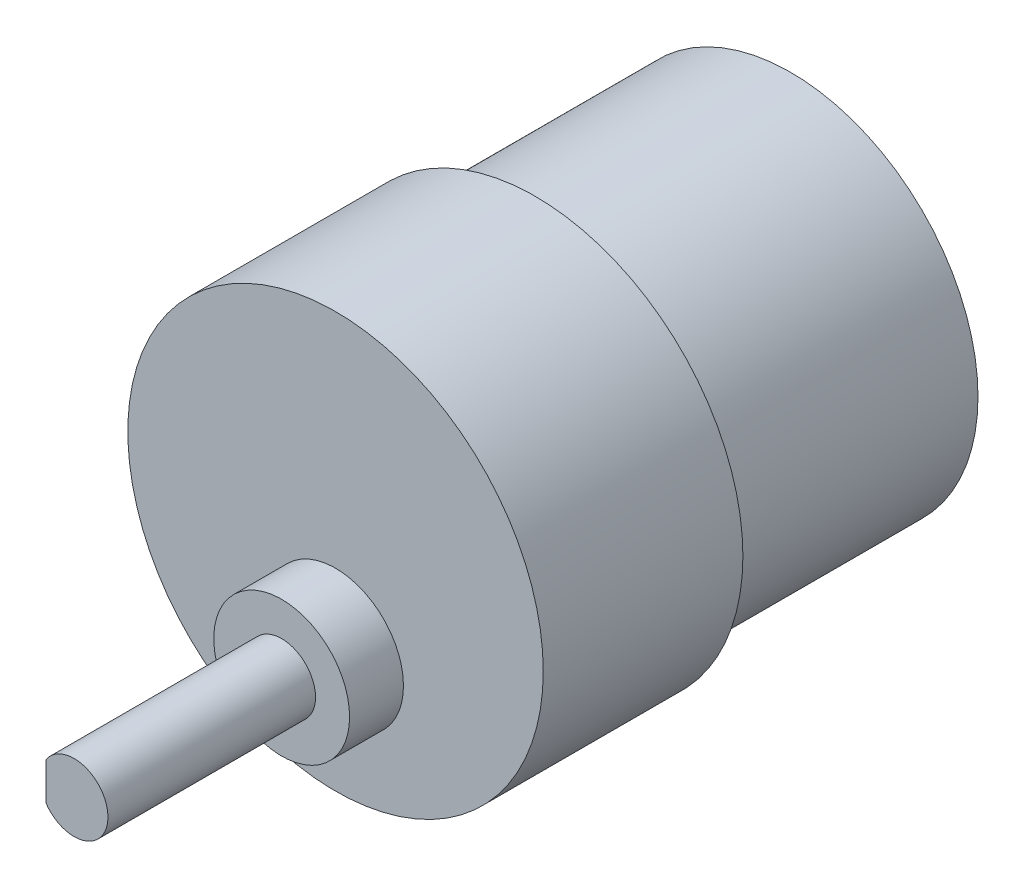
ISO-10303-21;
HEADER;
FILE_DESCRIPTION(('STEP AP214'),'2;1');
FILE_NAME('part.step','',(''),(''),'','','');
FILE_SCHEMA(('AUTOMOTIVE_DESIGN { 1 0 10303 214 1 1 1 1 }'));
ENDSEC;
DATA;
#1=APPLICATION_CONTEXT('core data for automotive mechanical design processes');
#2=APPLICATION_PROTOCOL_DEFINITION('international standard','automotive_design',2000,#1);
#3=PRODUCT_CONTEXT('',#1,'mechanical');
#4=PRODUCT('Part','Part','',(#3));
#5=PRODUCT_RELATED_PRODUCT_CATEGORY('part','',(#4));
#6=PRODUCT_DEFINITION_FORMATION('','',#4);
#7=PRODUCT_DEFINITION_CONTEXT('part definition',#1,'design');
#8=PRODUCT_DEFINITION('design','',#6,#7);
#9=PRODUCT_DEFINITION_SHAPE('','',#8);
#10=(LENGTH_UNIT() NAMED_UNIT(*) SI_UNIT(.MILLI.,.METRE.));
#11=(NAMED_UNIT(*) PLANE_ANGLE_UNIT() SI_UNIT($,.RADIAN.));
#12=(NAMED_UNIT(*) SI_UNIT($,.STERADIAN.) SOLID_ANGLE_UNIT());
#13=UNCERTAINTY_MEASURE_WITH_UNIT(LENGTH_MEASURE(1.E-05),#10,'distance_accuracy_value','');
#14=(GEOMETRIC_REPRESENTATION_CONTEXT(3) GLOBAL_UNCERTAINTY_ASSIGNED_CONTEXT((#13)) GLOBAL_UNIT_ASSIGNED_CONTEXT((#10,
#11,#12)) REPRESENTATION_CONTEXT('',''));
#15=CARTESIAN_POINT('',(0.,0.,0.));
#16=DIRECTION('',(0.,0.,1.));
#17=DIRECTION('',(1.,0.,0.));
#18=AXIS2_PLACEMENT_3D('',#15,#16,#17);
#19=CARTESIAN_POINT('',(0.,0.,22.5298));
#20=DIRECTION('',(0.,0.,-1.));
#21=DIRECTION('',(-1.,0.,0.));
#22=AXIS2_PLACEMENT_3D('',#19,#20,#21);
#23=CYLINDRICAL_SURFACE('',#22,16.51);
#24=CARTESIAN_POINT('',(0.,0.,22.5298));
#25=DIRECTION('',(0.,0.,1.));
#26=DIRECTION('',(1.,0.,0.));
#27=AXIS2_PLACEMENT_3D('',#24,#25,#26);
#28=CIRCLE('',#27,16.51);
#29=CARTESIAN_POINT('',(16.51,0.,22.5298));
#30=VERTEX_POINT('',#29);
#31=EDGE_CURVE('E40',#30,#30,#28,.T.);
#32=ORIENTED_EDGE('',*,*,#31,.F.);
#33=EDGE_LOOP('',(#32));
#34=FACE_BOUND('',#33,.T.);
#35=CARTESIAN_POINT('',(0.,0.,0.));
#36=DIRECTION('',(0.,0.,1.));
#37=DIRECTION('',(1.,0.,0.));
#38=AXIS2_PLACEMENT_3D('',#35,#36,#37);
#39=CIRCLE('',#38,16.51);
#40=CARTESIAN_POINT('',(16.51,0.,0.));
#41=VERTEX_POINT('',#40);
#42=EDGE_CURVE('E88',#41,#41,#39,.T.);
#43=ORIENTED_EDGE('',*,*,#42,.T.);
#44=EDGE_LOOP('',(#43));
#45=FACE_BOUND('',#44,.T.);
#46=ADVANCED_FACE('F33',(#34,#45),#23,.T.);
#47=CARTESIAN_POINT('',(0.,0.,0.));
#48=DIRECTION('',(0.,0.,1.));
#49=DIRECTION('',(1.,0.,0.));
#50=AXIS2_PLACEMENT_3D('',#47,#48,#49);
#51=PLANE('',#50);
#52=ORIENTED_EDGE('',*,*,#42,.F.);
#53=EDGE_LOOP('',(#52));
#54=FACE_BOUND('',#53,.T.);
#55=ADVANCED_FACE('F96',(#54),#51,.F.);
#56=CARTESIAN_POINT('',(0.,0.,40.132));
#57=DIRECTION('',(0.,0.,-1.));
#58=DIRECTION('',(-1.,0.,0.));
#59=AXIS2_PLACEMENT_3D('',#56,#57,#58);
#60=CYLINDRICAL_SURFACE('',#59,18.3134);
#61=CARTESIAN_POINT('',(0.,0.,40.132));
#62=DIRECTION('',(0.,0.,1.));
#63=DIRECTION('',(1.,0.,0.));
#64=AXIS2_PLACEMENT_3D('',#61,#62,#63);
#65=CIRCLE('',#64,18.3134);
#66=CARTESIAN_POINT('',(18.3134,0.,40.132));
#67=VERTEX_POINT('',#66);
#68=EDGE_CURVE('E85',#67,#67,#65,.T.);
#69=ORIENTED_EDGE('',*,*,#68,.F.);
#70=EDGE_LOOP('',(#69));
#71=FACE_BOUND('',#70,.T.);
#72=CARTESIAN_POINT('',(0.,0.,22.5298));
#73=DIRECTION('',(0.,0.,1.));
#74=DIRECTION('',(1.,0.,0.));
#75=AXIS2_PLACEMENT_3D('',#72,#73,#74);
#76=CIRCLE('',#75,18.3134);
#77=CARTESIAN_POINT('',(18.3134,0.,22.5298));
#78=VERTEX_POINT('',#77);
#79=EDGE_CURVE('E83',#78,#78,#76,.T.);
#80=ORIENTED_EDGE('',*,*,#79,.T.);
#81=EDGE_LOOP('',(#80));
#82=FACE_BOUND('',#81,.T.);
#83=ADVANCED_FACE('F98',(#71,#82),#60,.T.);
#84=CARTESIAN_POINT('',(0.,0.,40.132));
#85=DIRECTION('',(0.,0.,1.));
#86=DIRECTION('',(1.,0.,0.));
#87=AXIS2_PLACEMENT_3D('',#84,#85,#86);
#88=PLANE('',#87);
#89=CARTESIAN_POINT('',(0.,-7.27075,40.132));
#90=DIRECTION('',(0.,0.,1.));
#91=DIRECTION('',(1.,0.,0.));
#92=AXIS2_PLACEMENT_3D('',#89,#90,#91);
#93=CIRCLE('',#92,5.98805);
#94=CARTESIAN_POINT('',(5.98805,-7.27075,40.132));
#95=VERTEX_POINT('',#94);
#96=EDGE_CURVE('E72',#95,#95,#93,.T.);
#97=ORIENTED_EDGE('',*,*,#96,.F.);
#98=EDGE_LOOP('',(#97));
#99=FACE_BOUND('',#98,.T.);
#100=ORIENTED_EDGE('',*,*,#68,.T.);
#101=EDGE_LOOP('',(#100));
#102=FACE_BOUND('',#101,.T.);
#103=ADVANCED_FACE('F103',(#99,#102),#88,.T.);
#104=CARTESIAN_POINT('',(0.,0.,22.5298));
#105=DIRECTION('',(0.,0.,1.));
#106=DIRECTION('',(1.,0.,0.));
#107=AXIS2_PLACEMENT_3D('',#104,#105,#106);
#108=PLANE('',#107);
#109=ORIENTED_EDGE('',*,*,#31,.T.);
#110=EDGE_LOOP('',(#109));
#111=FACE_BOUND('',#110,.T.);
#112=ORIENTED_EDGE('',*,*,#79,.F.);
#113=EDGE_LOOP('',(#112));
#114=FACE_BOUND('',#113,.T.);
#115=ADVANCED_FACE('F108',(#111,#114),#108,.F.);
#116=CARTESIAN_POINT('',(0.,-7.27075,44.8818));
#117=DIRECTION('',(0.,0.,-1.));
#118=DIRECTION('',(-1.,0.,0.));
#119=AXIS2_PLACEMENT_3D('',#116,#117,#118);
#120=CYLINDRICAL_SURFACE('',#119,5.98805);
#121=CARTESIAN_POINT('',(0.,-7.27075,44.8818));
#122=DIRECTION('',(0.,0.,1.));
#123=DIRECTION('',(1.,0.,0.));
#124=AXIS2_PLACEMENT_3D('',#121,#122,#123);
#125=CIRCLE('',#124,5.98805);
#126=CARTESIAN_POINT('',(5.98805,-7.27075,44.8818));
#127=VERTEX_POINT('',#126);
#128=EDGE_CURVE('E76',#127,#127,#125,.T.);
#129=ORIENTED_EDGE('',*,*,#128,.F.);
#130=EDGE_LOOP('',(#129));
#131=FACE_BOUND('',#130,.T.);
#132=ORIENTED_EDGE('',*,*,#96,.T.);
#133=EDGE_LOOP('',(#132));
#134=FACE_BOUND('',#133,.T.);
#135=ADVANCED_FACE('F111',(#131,#134),#120,.T.);
#136=CARTESIAN_POINT('',(0.,-7.27075,44.8818));
#137=DIRECTION('',(0.,0.,1.));
#138=DIRECTION('',(1.,0.,0.));
#139=AXIS2_PLACEMENT_3D('',#136,#137,#138);
#140=PLANE('',#139);
#141=CARTESIAN_POINT('',(0.,-7.27075,44.8818));
#142=DIRECTION('',(0.,0.,1.));
#143=DIRECTION('',(1.,0.,0.));
#144=AXIS2_PLACEMENT_3D('',#141,#142,#143);
#145=CIRCLE('',#144,2.9845);
#146=CARTESIAN_POINT('',(2.9845,-7.27075,44.8818));
#147=VERTEX_POINT('',#146);
#148=EDGE_CURVE('E73',#147,#147,#145,.T.);
#149=ORIENTED_EDGE('',*,*,#148,.F.);
#150=EDGE_LOOP('',(#149));
#151=FACE_BOUND('',#150,.T.);
#152=ORIENTED_EDGE('',*,*,#128,.T.);
#153=EDGE_LOOP('',(#152));
#154=FACE_BOUND('',#153,.T.);
#155=ADVANCED_FACE('F118',(#151,#154),#140,.T.);
#156=CARTESIAN_POINT('',(0.,-7.27075,63.1825));
#157=DIRECTION('',(0.,0.,-1.));
#158=DIRECTION('',(-1.,0.,0.));
#159=AXIS2_PLACEMENT_3D('',#156,#157,#158);
#160=CYLINDRICAL_SURFACE('',#159,2.9845);
#161=CARTESIAN_POINT('',(0.,-7.27075,63.1825));
#162=DIRECTION('',(0.,0.,1.));
#163=DIRECTION('',(1.,0.,0.));
#164=AXIS2_PLACEMENT_3D('',#161,#162,#163);
#165=CIRCLE('',#164,2.9845);
#166=CARTESIAN_POINT('',(-2.4765,-8.93633938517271,63.1825));
#167=VERTEX_POINT('',#166);
#168=CARTESIAN_POINT('',(-2.4765,-5.60516061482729,63.1825));
#169=VERTEX_POINT('',#168);
#170=EDGE_CURVE('E69',#167,#169,#165,.T.);
#171=ORIENTED_EDGE('',*,*,#170,.F.);
#172=DIRECTION('',(0.,0.,1.));
#173=VECTOR('',#172,1.);
#174=CARTESIAN_POINT('',(-2.4765,-8.93633938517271,50.9905));
#175=LINE('',#174,#173);
#176=CARTESIAN_POINT('',(-2.4765,-8.93633938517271,50.9905));
#177=VERTEX_POINT('',#176);
#178=EDGE_CURVE('E47',#177,#167,#175,.T.);
#179=ORIENTED_EDGE('',*,*,#178,.F.);
#180=CARTESIAN_POINT('',(0.,-7.27075,50.9905));
#181=DIRECTION('',(0.,0.,1.));
#182=DIRECTION('',(1.,0.,0.));
#183=AXIS2_PLACEMENT_3D('',#180,#181,#182);
#184=CIRCLE('',#183,2.9845);
#185=CARTESIAN_POINT('',(-2.4765,-5.60516061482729,50.9905));
#186=VERTEX_POINT('',#185);
#187=EDGE_CURVE('E11',#186,#177,#184,.T.);
#188=ORIENTED_EDGE('',*,*,#187,.F.);
#189=DIRECTION('',(0.,0.,1.));
#190=VECTOR('',#189,1.);
#191=CARTESIAN_POINT('',(-2.4765,-5.60516061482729,50.9905));
#192=LINE('',#191,#190);
#193=EDGE_CURVE('E60',#186,#169,#192,.T.);
#194=ORIENTED_EDGE('',*,*,#193,.T.);
#195=EDGE_LOOP('',(#171,#179,#188,#194));
#196=FACE_BOUND('',#195,.T.);
#197=ORIENTED_EDGE('',*,*,#148,.T.);
#198=EDGE_LOOP('',(#197));
#199=FACE_BOUND('',#198,.T.);
#200=ADVANCED_FACE('F67',(#196,#199),#160,.T.);
#201=CARTESIAN_POINT('',(0.,-7.27075,63.1825));
#202=DIRECTION('',(0.,0.,1.));
#203=DIRECTION('',(1.,0.,0.));
#204=AXIS2_PLACEMENT_3D('',#201,#202,#203);
#205=PLANE('',#204);
#206=DIRECTION('',(0.,1.,0.));
#207=VECTOR('',#206,1.);
#208=CARTESIAN_POINT('',(-2.4765,-8.93633938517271,63.1825));
#209=LINE('',#208,#207);
#210=EDGE_CURVE('E57',#167,#169,#209,.T.);
#211=ORIENTED_EDGE('',*,*,#210,.F.);
#212=ORIENTED_EDGE('',*,*,#170,.T.);
#213=EDGE_LOOP('',(#211,#212));
#214=FACE_BOUND('',#213,.T.);
#215=ADVANCED_FACE('F71',(#214),#205,.T.);
#216=CARTESIAN_POINT('',(0.,0.,50.9905));
#217=DIRECTION('',(0.,0.,1.));
#218=DIRECTION('',(1.,0.,0.));
#219=AXIS2_PLACEMENT_3D('',#216,#217,#218);
#220=PLANE('',#219);
#221=ORIENTED_EDGE('',*,*,#187,.T.);
#222=DIRECTION('',(0.,1.,0.));
#223=VECTOR('',#222,1.);
#224=CARTESIAN_POINT('',(-2.4765,-8.93633938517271,50.9905));
#225=LINE('',#224,#223);
#226=EDGE_CURVE('E64',#177,#186,#225,.T.);
#227=ORIENTED_EDGE('',*,*,#226,.T.);
#228=EDGE_LOOP('',(#221,#227));
#229=FACE_BOUND('',#228,.T.);
#230=ADVANCED_FACE('F127',(#229),#220,.T.);
#231=CARTESIAN_POINT('',(-2.4765,-8.93633938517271,50.9905));
#232=DIRECTION('',(1.,0.,0.));
#233=DIRECTION('',(0.,0.,-1.));
#234=AXIS2_PLACEMENT_3D('',#231,#232,#233);
#235=PLANE('',#234);
#236=ORIENTED_EDGE('',*,*,#210,.T.);
#237=ORIENTED_EDGE('',*,*,#193,.F.);
#238=ORIENTED_EDGE('',*,*,#226,.F.);
#239=ORIENTED_EDGE('',*,*,#178,.T.);
#240=EDGE_LOOP('',(#236,#237,#238,#239));
#241=FACE_BOUND('',#240,.T.);
#242=ADVANCED_FACE('F59',(#241),#235,.F.);
#243=CLOSED_SHELL('',(#46,#55,#83,#103,#115,#135,#155,#200,#215,#230,#242));
#244=MANIFOLD_SOLID_BREP('B2',#243);
#245=ADVANCED_BREP_SHAPE_REPRESENTATION('',(#18,#244),#14);
#246=SHAPE_DEFINITION_REPRESENTATION(#9,#245);
ENDSEC;
END-ISO-10303-21;
